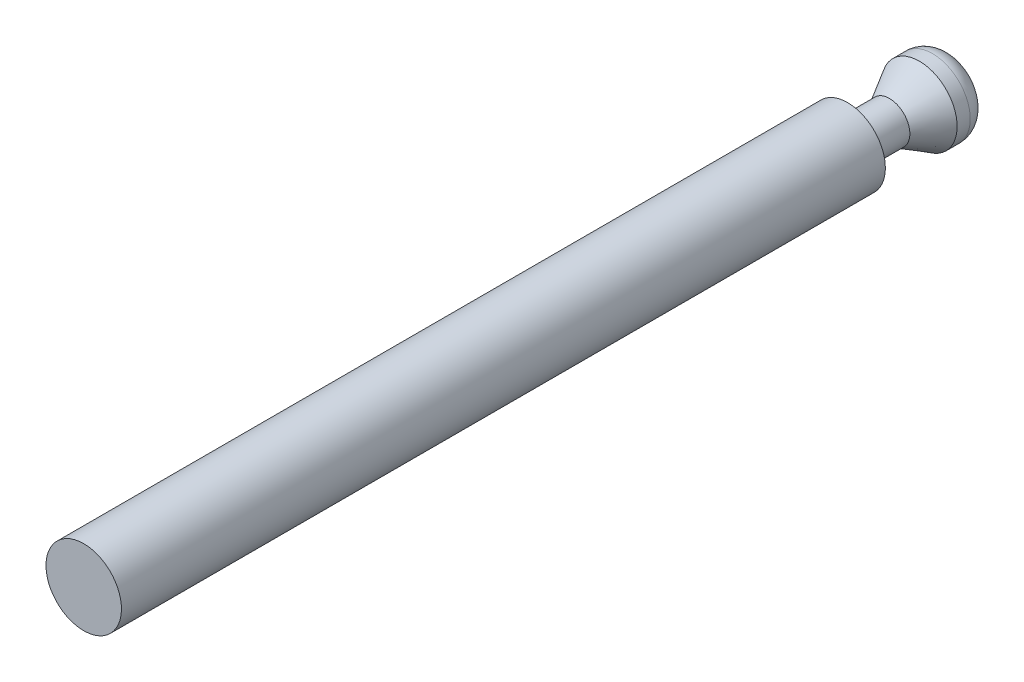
ISO-10303-21;
HEADER;
FILE_DESCRIPTION(('STEP AP214'),'2;1');
FILE_NAME('part.step','',(''),(''),'','','');
FILE_SCHEMA(('AUTOMOTIVE_DESIGN { 1 0 10303 214 1 1 1 1 }'));
ENDSEC;
DATA;
#1=APPLICATION_CONTEXT('core data for automotive mechanical design processes');
#2=APPLICATION_PROTOCOL_DEFINITION('international standard','automotive_design',2000,#1);
#3=PRODUCT_CONTEXT('',#1,'mechanical');
#4=PRODUCT('Part','Part','',(#3));
#5=PRODUCT_RELATED_PRODUCT_CATEGORY('part','',(#4));
#6=PRODUCT_DEFINITION_FORMATION('','',#4);
#7=PRODUCT_DEFINITION_CONTEXT('part definition',#1,'design');
#8=PRODUCT_DEFINITION('design','',#6,#7);
#9=PRODUCT_DEFINITION_SHAPE('','',#8);
#10=(LENGTH_UNIT() NAMED_UNIT(*) SI_UNIT(.MILLI.,.METRE.));
#11=(NAMED_UNIT(*) PLANE_ANGLE_UNIT() SI_UNIT($,.RADIAN.));
#12=(NAMED_UNIT(*) SI_UNIT($,.STERADIAN.) SOLID_ANGLE_UNIT());
#13=UNCERTAINTY_MEASURE_WITH_UNIT(LENGTH_MEASURE(1.E-05),#10,'distance_accuracy_value','');
#14=(GEOMETRIC_REPRESENTATION_CONTEXT(3) GLOBAL_UNCERTAINTY_ASSIGNED_CONTEXT((#13)) GLOBAL_UNIT_ASSIGNED_CONTEXT((#10,
#11,#12)) REPRESENTATION_CONTEXT('',''));
#15=CARTESIAN_POINT('',(0.,0.,0.));
#16=DIRECTION('',(0.,0.,1.));
#17=DIRECTION('',(1.,0.,0.));
#18=AXIS2_PLACEMENT_3D('',#15,#16,#17);
#19=CARTESIAN_POINT('',(0.,0.,-100.));
#20=DIRECTION('',(0.,0.,-1.));
#21=DIRECTION('',(0.,1.,0.));
#22=AXIS2_PLACEMENT_3D('',#19,#20,#21);
#23=CYLINDRICAL_SURFACE('',#22,6.);
#24=CARTESIAN_POINT('',(0.,0.,-121.5));
#25=DIRECTION('',(0.,0.,-1.));
#26=DIRECTION('',(0.,1.,0.));
#27=AXIS2_PLACEMENT_3D('',#24,#25,#26);
#28=CIRCLE('',#27,6.);
#29=CARTESIAN_POINT('',(0.,6.,-121.5));
#30=VERTEX_POINT('',#29);
#31=EDGE_CURVE('E38',#30,#30,#28,.T.);
#32=ORIENTED_EDGE('',*,*,#31,.F.);
#33=EDGE_LOOP('',(#32));
#34=FACE_BOUND('',#33,.T.);
#35=CARTESIAN_POINT('',(0.,0.,0.));
#36=DIRECTION('',(0.,0.,-1.));
#37=DIRECTION('',(-1.,0.,0.));
#38=AXIS2_PLACEMENT_3D('',#35,#36,#37);
#39=CIRCLE('',#38,6.);
#40=CARTESIAN_POINT('',(-6.,0.,0.));
#41=VERTEX_POINT('',#40);
#42=EDGE_CURVE('E41',#41,#41,#39,.F.);
#43=ORIENTED_EDGE('',*,*,#42,.F.);
#44=EDGE_LOOP('',(#43));
#45=FACE_BOUND('',#44,.T.);
#46=ADVANCED_FACE('F12',(#34,#45),#23,.T.);
#47=CARTESIAN_POINT('',(0.,0.,-138.));
#48=DIRECTION('',(0.,0.,-1.));
#49=DIRECTION('',(0.,1.,0.));
#50=AXIS2_PLACEMENT_3D('',#47,#48,#49);
#51=PLANE('',#50);
#52=CARTESIAN_POINT('',(0.,0.,-138.));
#53=DIRECTION('',(0.,0.,-1.));
#54=DIRECTION('',(0.,1.,0.));
#55=AXIS2_PLACEMENT_3D('',#52,#53,#54);
#56=CIRCLE('',#55,3.);
#57=CARTESIAN_POINT('',(0.,3.,-138.));
#58=VERTEX_POINT('',#57);
#59=EDGE_CURVE('E19',#58,#58,#56,.T.);
#60=ORIENTED_EDGE('',*,*,#59,.T.);
#61=EDGE_LOOP('',(#60));
#62=FACE_BOUND('',#61,.T.);
#63=ADVANCED_FACE('F14',(#62),#51,.T.);
#64=CARTESIAN_POINT('',(0.,0.,-100.));
#65=DIRECTION('',(0.,0.,-1.));
#66=DIRECTION('',(0.,1.,0.));
#67=AXIS2_PLACEMENT_3D('',#64,#65,#66);
#68=CYLINDRICAL_SURFACE('',#67,6.);
#69=CARTESIAN_POINT('',(0.,0.,-135.));
#70=DIRECTION('',(0.,0.,-1.));
#71=DIRECTION('',(0.,1.,0.));
#72=AXIS2_PLACEMENT_3D('',#69,#70,#71);
#73=CIRCLE('',#72,6.);
#74=CARTESIAN_POINT('',(0.,6.,-135.));
#75=VERTEX_POINT('',#74);
#76=EDGE_CURVE('E8',#75,#75,#73,.F.);
#77=ORIENTED_EDGE('',*,*,#76,.T.);
#78=EDGE_LOOP('',(#77));
#79=FACE_BOUND('',#78,.T.);
#80=CARTESIAN_POINT('',(0.,0.,-132.913139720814));
#81=DIRECTION('',(0.,0.,-1.));
#82=DIRECTION('',(0.,1.,0.));
#83=AXIS2_PLACEMENT_3D('',#80,#81,#82);
#84=CIRCLE('',#83,6.);
#85=CARTESIAN_POINT('',(0.,6.,-132.913139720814));
#86=VERTEX_POINT('',#85);
#87=EDGE_CURVE('E32',#86,#86,#84,.T.);
#88=ORIENTED_EDGE('',*,*,#87,.T.);
#89=EDGE_LOOP('',(#88));
#90=FACE_BOUND('',#89,.T.);
#91=ADVANCED_FACE('F55',(#79,#90),#68,.T.);
#92=CARTESIAN_POINT('',(0.,0.,-132.913139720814));
#93=DIRECTION('',(0.,0.,-1.));
#94=DIRECTION('',(0.,1.,0.));
#95=AXIS2_PLACEMENT_3D('',#92,#93,#94);
#96=CONICAL_SURFACE('',#95,6.,0.523598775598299);
#97=CARTESIAN_POINT('',(0.,0.,-128.15));
#98=DIRECTION('',(0.,0.,-1.));
#99=DIRECTION('',(0.,1.,0.));
#100=AXIS2_PLACEMENT_3D('',#97,#98,#99);
#101=CIRCLE('',#100,3.25);
#102=CARTESIAN_POINT('',(0.,3.25,-128.15));
#103=VERTEX_POINT('',#102);
#104=EDGE_CURVE('E35',#103,#103,#101,.T.);
#105=ORIENTED_EDGE('',*,*,#104,.T.);
#106=EDGE_LOOP('',(#105));
#107=FACE_BOUND('',#106,.T.);
#108=ORIENTED_EDGE('',*,*,#87,.F.);
#109=EDGE_LOOP('',(#108));
#110=FACE_BOUND('',#109,.T.);
#111=ADVANCED_FACE('F68',(#107,#110),#96,.T.);
#112=CARTESIAN_POINT('',(0.,0.,-100.));
#113=DIRECTION('',(0.,0.,-1.));
#114=DIRECTION('',(0.,1.,0.));
#115=AXIS2_PLACEMENT_3D('',#112,#113,#114);
#116=CYLINDRICAL_SURFACE('',#115,3.25);
#117=CARTESIAN_POINT('',(0.,0.,-122.5));
#118=DIRECTION('',(0.,0.,-1.));
#119=DIRECTION('',(0.,1.,0.));
#120=AXIS2_PLACEMENT_3D('',#117,#118,#119);
#121=CIRCLE('',#120,3.25);
#122=CARTESIAN_POINT('',(0.,3.25,-122.5));
#123=VERTEX_POINT('',#122);
#124=EDGE_CURVE('E27',#123,#123,#121,.T.);
#125=ORIENTED_EDGE('',*,*,#124,.T.);
#126=EDGE_LOOP('',(#125));
#127=FACE_BOUND('',#126,.T.);
#128=ORIENTED_EDGE('',*,*,#104,.F.);
#129=EDGE_LOOP('',(#128));
#130=FACE_BOUND('',#129,.T.);
#131=ADVANCED_FACE('F64',(#127,#130),#116,.T.);
#132=CARTESIAN_POINT('',(3.25,0.,-121.5));
#133=DIRECTION('',(0.,0.,-1.));
#134=DIRECTION('',(0.,1.,0.));
#135=AXIS2_PLACEMENT_3D('',#132,#133,#134);
#136=PLANE('',#135);
#137=CARTESIAN_POINT('',(0.,0.,-121.5));
#138=DIRECTION('',(0.,0.,-1.));
#139=DIRECTION('',(0.,1.,0.));
#140=AXIS2_PLACEMENT_3D('',#137,#138,#139);
#141=CIRCLE('',#140,4.25);
#142=CARTESIAN_POINT('',(0.,4.25,-121.5));
#143=VERTEX_POINT('',#142);
#144=EDGE_CURVE('E23',#143,#143,#141,.F.);
#145=ORIENTED_EDGE('',*,*,#144,.T.);
#146=EDGE_LOOP('',(#145));
#147=FACE_BOUND('',#146,.T.);
#148=ORIENTED_EDGE('',*,*,#31,.T.);
#149=EDGE_LOOP('',(#148));
#150=FACE_BOUND('',#149,.T.);
#151=ADVANCED_FACE('F61',(#147,#150),#136,.T.);
#152=CARTESIAN_POINT('',(0.,0.,-122.5));
#153=DIRECTION('',(0.,0.,-1.));
#154=DIRECTION('',(0.,1.,0.));
#155=AXIS2_PLACEMENT_3D('',#152,#153,#154);
#156=TOROIDAL_SURFACE('',#155,4.25,1.);
#157=ORIENTED_EDGE('',*,*,#144,.F.);
#158=EDGE_LOOP('',(#157));
#159=FACE_BOUND('',#158,.T.);
#160=ORIENTED_EDGE('',*,*,#124,.F.);
#161=EDGE_LOOP('',(#160));
#162=FACE_BOUND('',#161,.T.);
#163=ADVANCED_FACE('F59',(#159,#162),#156,.F.);
#164=CARTESIAN_POINT('',(0.,0.,-135.));
#165=DIRECTION('',(0.,0.,-1.));
#166=DIRECTION('',(0.,1.,0.));
#167=AXIS2_PLACEMENT_3D('',#164,#165,#166);
#168=DEGENERATE_TOROIDAL_SURFACE('',#167,3.,3.,.T.);
#169=ORIENTED_EDGE('',*,*,#76,.F.);
#170=EDGE_LOOP('',(#169));
#171=FACE_BOUND('',#170,.T.);
#172=ORIENTED_EDGE('',*,*,#59,.F.);
#173=EDGE_LOOP('',(#172));
#174=FACE_BOUND('',#173,.T.);
#175=ADVANCED_FACE('F107',(#171,#174),#168,.T.);
#176=CARTESIAN_POINT('',(0.,0.,0.));
#177=DIRECTION('',(0.,0.,-1.));
#178=DIRECTION('',(-1.,0.,0.));
#179=AXIS2_PLACEMENT_3D('',#176,#177,#178);
#180=PLANE('',#179);
#181=ORIENTED_EDGE('',*,*,#42,.T.);
#182=EDGE_LOOP('',(#181));
#183=FACE_BOUND('',#182,.T.);
#184=ADVANCED_FACE('F45',(#183),#180,.F.);
#185=CLOSED_SHELL('',(#46,#63,#91,#111,#131,#151,#163,#175,#184));
#186=MANIFOLD_SOLID_BREP('B1',#185);
#187=ADVANCED_BREP_SHAPE_REPRESENTATION('',(#18,#186),#14);
#188=SHAPE_DEFINITION_REPRESENTATION(#9,#187);
ENDSEC;
END-ISO-10303-21;
